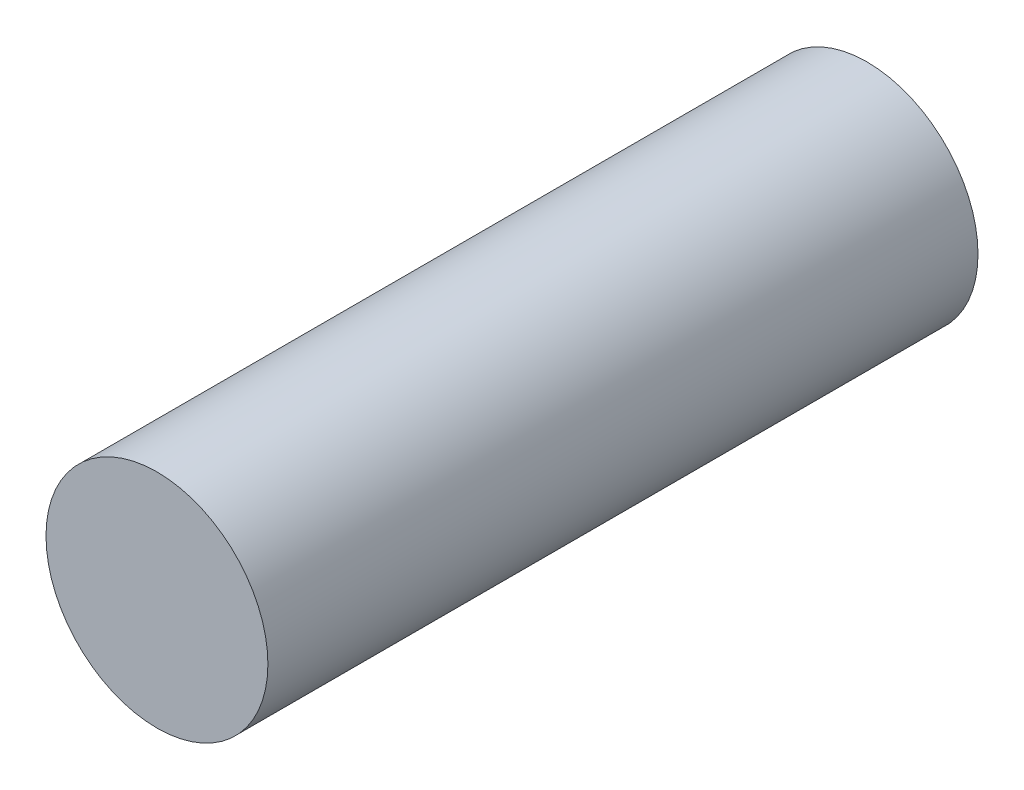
ISO-10303-21;
HEADER;
FILE_DESCRIPTION(('STEP AP214'),'2;1');
FILE_NAME('part.step','',(''),(''),'','','');
FILE_SCHEMA(('AUTOMOTIVE_DESIGN { 1 0 10303 214 1 1 1 1 }'));
ENDSEC;
DATA;
#1=APPLICATION_CONTEXT('core data for automotive mechanical design processes');
#2=APPLICATION_PROTOCOL_DEFINITION('international standard','automotive_design',2000,#1);
#3=PRODUCT_CONTEXT('',#1,'mechanical');
#4=PRODUCT('Part','Part','',(#3));
#5=PRODUCT_RELATED_PRODUCT_CATEGORY('part','',(#4));
#6=PRODUCT_DEFINITION_FORMATION('','',#4);
#7=PRODUCT_DEFINITION_CONTEXT('part definition',#1,'design');
#8=PRODUCT_DEFINITION('design','',#6,#7);
#9=PRODUCT_DEFINITION_SHAPE('','',#8);
#10=(LENGTH_UNIT() NAMED_UNIT(*) SI_UNIT(.MILLI.,.METRE.));
#11=(NAMED_UNIT(*) PLANE_ANGLE_UNIT() SI_UNIT($,.RADIAN.));
#12=(NAMED_UNIT(*) SI_UNIT($,.STERADIAN.) SOLID_ANGLE_UNIT());
#13=UNCERTAINTY_MEASURE_WITH_UNIT(LENGTH_MEASURE(1.E-05),#10,'distance_accuracy_value','');
#14=(GEOMETRIC_REPRESENTATION_CONTEXT(3) GLOBAL_UNCERTAINTY_ASSIGNED_CONTEXT((#13)) GLOBAL_UNIT_ASSIGNED_CONTEXT((#10,
#11,#12)) REPRESENTATION_CONTEXT('',''));
#15=CARTESIAN_POINT('',(0.,0.,0.));
#16=DIRECTION('',(0.,0.,1.));
#17=DIRECTION('',(1.,0.,0.));
#18=AXIS2_PLACEMENT_3D('',#15,#16,#17);
#19=CARTESIAN_POINT('',(0.,0.,20.32));
#20=DIRECTION('',(0.,0.,-1.));
#21=DIRECTION('',(-1.,0.,0.));
#22=AXIS2_PLACEMENT_3D('',#19,#20,#21);
#23=CYLINDRICAL_SURFACE('',#22,3.175);
#24=CARTESIAN_POINT('',(0.,0.,20.32));
#25=DIRECTION('',(0.,0.,1.));
#26=DIRECTION('',(1.,0.,0.));
#27=AXIS2_PLACEMENT_3D('',#24,#25,#26);
#28=CIRCLE('',#27,3.175);
#29=CARTESIAN_POINT('',(3.175,0.,20.32));
#30=VERTEX_POINT('',#29);
#31=EDGE_CURVE('E10',#30,#30,#28,.T.);
#32=ORIENTED_EDGE('',*,*,#31,.F.);
#33=EDGE_LOOP('',(#32));
#34=FACE_BOUND('',#33,.T.);
#35=CARTESIAN_POINT('',(0.,0.,0.));
#36=DIRECTION('',(0.,0.,1.));
#37=DIRECTION('',(1.,0.,0.));
#38=AXIS2_PLACEMENT_3D('',#35,#36,#37);
#39=CIRCLE('',#38,3.175);
#40=CARTESIAN_POINT('',(3.175,0.,0.));
#41=VERTEX_POINT('',#40);
#42=EDGE_CURVE('E33',#41,#41,#39,.T.);
#43=ORIENTED_EDGE('',*,*,#42,.T.);
#44=EDGE_LOOP('',(#43));
#45=FACE_BOUND('',#44,.T.);
#46=ADVANCED_FACE('F30',(#34,#45),#23,.T.);
#47=CARTESIAN_POINT('',(0.,0.,20.32));
#48=DIRECTION('',(0.,0.,1.));
#49=DIRECTION('',(1.,0.,0.));
#50=AXIS2_PLACEMENT_3D('',#47,#48,#49);
#51=PLANE('',#50);
#52=ORIENTED_EDGE('',*,*,#31,.T.);
#53=EDGE_LOOP('',(#52));
#54=FACE_BOUND('',#53,.T.);
#55=ADVANCED_FACE('F45',(#54),#51,.T.);
#56=CARTESIAN_POINT('',(0.,0.,0.));
#57=DIRECTION('',(0.,0.,1.));
#58=DIRECTION('',(1.,0.,0.));
#59=AXIS2_PLACEMENT_3D('',#56,#57,#58);
#60=PLANE('',#59);
#61=ORIENTED_EDGE('',*,*,#42,.F.);
#62=EDGE_LOOP('',(#61));
#63=FACE_BOUND('',#62,.T.);
#64=ADVANCED_FACE('F43',(#63),#60,.F.);
#65=CLOSED_SHELL('',(#46,#55,#64));
#66=MANIFOLD_SOLID_BREP('B2',#65);
#67=ADVANCED_BREP_SHAPE_REPRESENTATION('',(#18,#66),#14);
#68=SHAPE_DEFINITION_REPRESENTATION(#9,#67);
ENDSEC;
END-ISO-10303-21;
